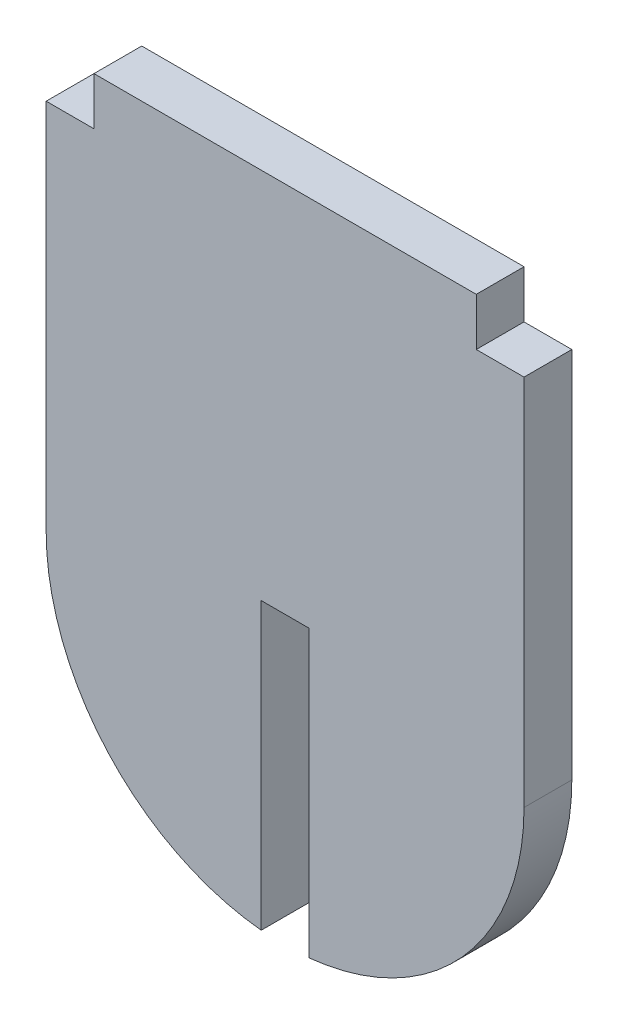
from build123d import *

# Parameters (mm, degrees)
BOSS_EXTRUDE1_DEPTH = 3.175
SKETCH2_W           = 3.175
SKETCH2_H           = 3.175
CUT_EXTRUDE1_DEPTH  = 34.953207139
SKETCH3_W           = 3.175
SKETCH3_H           = 19.05
CUT_EXTRUDE2_DEPTH  = 34.953207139


with BuildPart() as part:
    # Sketch1 → Boss-Extrude1 (new body)
    with BuildSketch(Plane.XY):
        with BuildLine():
            Line((-15.875, 13.97), (15.875, 13.97))
            Line((15.875, 13.97), (15.875, -13.97))
            ThreePointArc((15.875, -13.97), (0, -29.845), (-15.875, -13.97))
            Line((-15.875, -13.97), (-15.875, 13.97))
        make_face()
    extrude(amount=BOSS_EXTRUDE1_DEPTH)

    # Sketch2 → Cut-Extrude1 (cut, through all)
    with BuildSketch(Plane.XY.offset(3.175)):
        with Locations((-14.2875, 12.3825)):
            Rectangle(SKETCH2_W, SKETCH2_H)
        with Locations((14.2875, 12.3825)):
            Rectangle(SKETCH2_W, SKETCH2_H)
    extrude(amount=-CUT_EXTRUDE1_DEPTH, mode=Mode.SUBTRACT)

    # Sketch3 → Cut-Extrude2 (cut, through all)
    with BuildSketch(Plane.XY.offset(3.175)):
        with Locations((0, -20.32)):
            Rectangle(SKETCH3_W, SKETCH3_H)
    extrude(amount=-CUT_EXTRUDE2_DEPTH, mode=Mode.SUBTRACT)


solid = part.part
